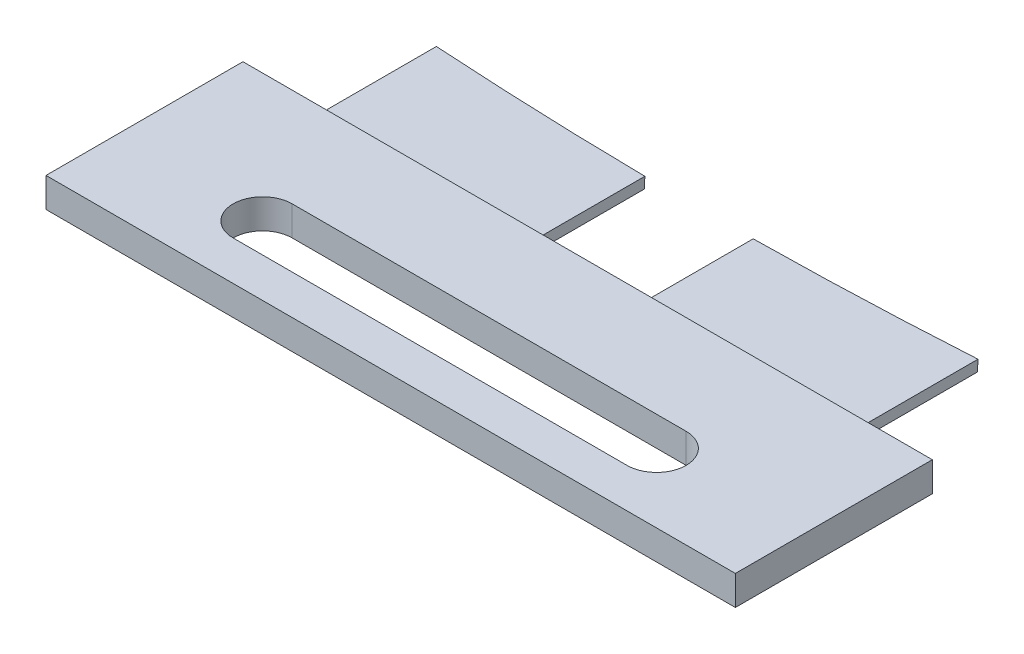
ISO-10303-21;
HEADER;
FILE_DESCRIPTION(('STEP AP214'),'2;1');
FILE_NAME('part.step','',(''),(''),'','','');
FILE_SCHEMA(('AUTOMOTIVE_DESIGN { 1 0 10303 214 1 1 1 1 }'));
ENDSEC;
DATA;
#1=APPLICATION_CONTEXT('core data for automotive mechanical design processes');
#2=APPLICATION_PROTOCOL_DEFINITION('international standard','automotive_design',2000,#1);
#3=PRODUCT_CONTEXT('',#1,'mechanical');
#4=PRODUCT('Part','Part','',(#3));
#5=PRODUCT_RELATED_PRODUCT_CATEGORY('part','',(#4));
#6=PRODUCT_DEFINITION_FORMATION('','',#4);
#7=PRODUCT_DEFINITION_CONTEXT('part definition',#1,'design');
#8=PRODUCT_DEFINITION('design','',#6,#7);
#9=PRODUCT_DEFINITION_SHAPE('','',#8);
#10=(LENGTH_UNIT() NAMED_UNIT(*) SI_UNIT(.MILLI.,.METRE.));
#11=(NAMED_UNIT(*) PLANE_ANGLE_UNIT() SI_UNIT($,.RADIAN.));
#12=(NAMED_UNIT(*) SI_UNIT($,.STERADIAN.) SOLID_ANGLE_UNIT());
#13=UNCERTAINTY_MEASURE_WITH_UNIT(LENGTH_MEASURE(1.E-05),#10,'distance_accuracy_value','');
#14=(GEOMETRIC_REPRESENTATION_CONTEXT(3) GLOBAL_UNCERTAINTY_ASSIGNED_CONTEXT((#13)) GLOBAL_UNIT_ASSIGNED_CONTEXT((#10,
#11,#12)) REPRESENTATION_CONTEXT('',''));
#15=CARTESIAN_POINT('',(0.,0.,0.));
#16=DIRECTION('',(0.,0.,1.));
#17=DIRECTION('',(1.,0.,0.));
#18=AXIS2_PLACEMENT_3D('',#15,#16,#17);
#19=CARTESIAN_POINT('',(-27.469753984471,-2.07937863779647E-12,23.2707232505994));
#20=DIRECTION('',(1.,0.,0.));
#21=DIRECTION('',(0.,1.,0.));
#22=AXIS2_PLACEMENT_3D('',#19,#20,#21);
#23=PLANE('',#22);
#24=CARTESIAN_POINT('',(-27.4697539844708,-2.45782713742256,25.6413464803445));
#25=CARTESIAN_POINT('',(-27.4697539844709,-1.14642170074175,25.5724833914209));
#26=CARTESIAN_POINT('',(-27.469753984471,0.164983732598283,25.5036202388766));
#27=CARTESIAN_POINT('',(-27.4697539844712,2.78779459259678,25.3658938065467));
#28=CARTESIAN_POINT('',(-27.4697539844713,4.09920001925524,25.2970305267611));
#29=CARTESIAN_POINT('',(-27.4697539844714,5.41060544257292,25.2281671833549));
#30=B_SPLINE_CURVE_WITH_KNOTS('',3,(#24,#25,#26,#27,#28,#29),.UNSPECIFIED.,.F.,.F.,(4,2,4),(0.,
3.93963667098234,7.87927334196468),.UNSPECIFIED.);
#31=CARTESIAN_POINT('',(-27.4697539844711,1.1961213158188,25.4494741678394));
#32=VERTEX_POINT('',#31);
#33=CARTESIAN_POINT('',(-27.4697539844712,2.2961213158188,25.3917120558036));
#34=VERTEX_POINT('',#33);
#35=EDGE_CURVE('E267',#32,#34,#30,.T.);
#36=ORIENTED_EDGE('',*,*,#35,.F.);
#37=DIRECTION('',(0.,0.,1.));
#38=VECTOR('',#37,1.);
#39=CARTESIAN_POINT('',(-27.4697539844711,1.1961213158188,23.2707232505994));
#40=LINE('',#39,#38);
#41=CARTESIAN_POINT('',(-27.4697539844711,1.1961213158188,37.5));
#42=VERTEX_POINT('',#41);
#43=EDGE_CURVE('E39',#32,#42,#40,.T.);
#44=ORIENTED_EDGE('',*,*,#43,.T.);
#45=DIRECTION('',(0.,1.,0.));
#46=VECTOR('',#45,1.);
#47=CARTESIAN_POINT('',(-27.469753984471,-2.07937863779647E-12,37.5));
#48=LINE('',#47,#46);
#49=CARTESIAN_POINT('',(-27.4697539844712,2.2961213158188,37.5));
#50=VERTEX_POINT('',#49);
#51=EDGE_CURVE('E283',#42,#50,#48,.T.);
#52=ORIENTED_EDGE('',*,*,#51,.T.);
#53=DIRECTION('',(0.,0.,1.));
#54=VECTOR('',#53,1.);
#55=CARTESIAN_POINT('',(-27.4697539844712,2.2961213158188,23.2707232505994));
#56=LINE('',#55,#54);
#57=EDGE_CURVE('E279',#34,#50,#56,.T.);
#58=ORIENTED_EDGE('',*,*,#57,.F.);
#59=EDGE_LOOP('',(#36,#44,#52,#58));
#60=FACE_BOUND('',#59,.T.);
#61=ADVANCED_FACE('F34',(#60),#23,.F.);
#62=CARTESIAN_POINT('',(0.,2.2961213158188,23.2707232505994));
#63=DIRECTION('',(0.,-1.,0.));
#64=DIRECTION('',(0.,0.,-1.));
#65=AXIS2_PLACEMENT_3D('',#62,#63,#64);
#66=PLANE('',#65);
#67=CARTESIAN_POINT('',(0.0302460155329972,2.2961213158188,-412.499994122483));
#68=DIRECTION('',(0.,-1.,0.));
#69=DIRECTION('',(0.,0.,-1.));
#70=AXIS2_PLACEMENT_3D('',#67,#68,#69);
#71=CIRCLE('',#70,438.754369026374);
#72=CARTESIAN_POINT('',(-5.46975398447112,2.2961213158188,26.2199009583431));
#73=VERTEX_POINT('',#72);
#74=EDGE_CURVE('E44',#34,#73,#71,.F.);
#75=ORIENTED_EDGE('',*,*,#74,.F.);
#76=ORIENTED_EDGE('',*,*,#57,.T.);
#77=DIRECTION('',(1.,0.,0.));
#78=VECTOR('',#77,1.);
#79=CARTESIAN_POINT('',(0.,2.2961213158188,37.5));
#80=LINE('',#79,#78);
#81=CARTESIAN_POINT('',(-5.46975398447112,2.2961213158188,37.5));
#82=VERTEX_POINT('',#81);
#83=EDGE_CURVE('E282',#50,#82,#80,.T.);
#84=ORIENTED_EDGE('',*,*,#83,.T.);
#85=DIRECTION('',(0.,0.,1.));
#86=VECTOR('',#85,1.);
#87=CARTESIAN_POINT('',(-5.46975398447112,2.2961213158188,23.2707232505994));
#88=LINE('',#87,#86);
#89=EDGE_CURVE('E284',#73,#82,#88,.T.);
#90=ORIENTED_EDGE('',*,*,#89,.F.);
#91=EDGE_LOOP('',(#75,#76,#84,#90));
#92=FACE_BOUND('',#91,.T.);
#93=ADVANCED_FACE('F255',(#92),#66,.F.);
#94=CARTESIAN_POINT('',(-5.46975398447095,-3.96792263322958E-13,23.2707232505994));
#95=DIRECTION('',(-1.,0.,0.));
#96=DIRECTION('',(0.,-1.,0.));
#97=AXIS2_PLACEMENT_3D('',#94,#95,#96);
#98=PLANE('',#97);
#99=CARTESIAN_POINT('',(-5.46975398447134,5.40928791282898,26.0567339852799));
#100=CARTESIAN_POINT('',(-5.46975398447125,4.09787568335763,26.1254675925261));
#101=CARTESIAN_POINT('',(-5.46975398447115,2.78646345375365,26.1942011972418));
#102=CARTESIAN_POINT('',(-5.46975398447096,0.163638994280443,26.3316684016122));
#103=CARTESIAN_POINT('',(-5.46975398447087,-1.14777323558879,26.4004020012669));
#104=CARTESIAN_POINT('',(-5.46975398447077,-2.45918546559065,26.4691355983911));
#105=B_SPLINE_CURVE_WITH_KNOTS('',3,(#99,#100,#101,#102,#103,#104),.UNSPECIFIED.,.F.,.F.,(4,2,
4),(0.,3.93963667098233,7.87927334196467),.UNSPECIFIED.);
#106=CARTESIAN_POINT('',(-5.46975398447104,1.1961213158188,26.2775540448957));
#107=VERTEX_POINT('',#106);
#108=EDGE_CURVE('E11',#73,#107,#105,.T.);
#109=ORIENTED_EDGE('',*,*,#108,.F.);
#110=ORIENTED_EDGE('',*,*,#89,.T.);
#111=DIRECTION('',(0.,-1.,0.));
#112=VECTOR('',#111,1.);
#113=CARTESIAN_POINT('',(-5.46975398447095,-3.96792263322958E-13,37.5));
#114=LINE('',#113,#112);
#115=CARTESIAN_POINT('',(-5.46975398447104,1.1961213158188,37.5));
#116=VERTEX_POINT('',#115);
#117=EDGE_CURVE('E286',#82,#116,#114,.T.);
#118=ORIENTED_EDGE('',*,*,#117,.T.);
#119=DIRECTION('',(0.,0.,1.));
#120=VECTOR('',#119,1.);
#121=CARTESIAN_POINT('',(-5.46975398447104,1.1961213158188,23.2707232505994));
#122=LINE('',#121,#120);
#123=EDGE_CURVE('E287',#107,#116,#122,.T.);
#124=ORIENTED_EDGE('',*,*,#123,.F.);
#125=EDGE_LOOP('',(#109,#110,#118,#124));
#126=FACE_BOUND('',#125,.T.);
#127=ADVANCED_FACE('F260',(#126),#98,.F.);
#128=CARTESIAN_POINT('',(0.,1.1961213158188,23.2707232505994));
#129=DIRECTION('',(0.,1.,0.));
#130=DIRECTION('',(-1.,0.,0.));
#131=AXIS2_PLACEMENT_3D('',#128,#129,#130);
#132=PLANE('',#131);
#133=CARTESIAN_POINT('',(0.0302460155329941,1.1961213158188,-412.499994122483));
#134=DIRECTION('',(0.,1.,0.));
#135=DIRECTION('',(-1.,0.,0.));
#136=AXIS2_PLACEMENT_3D('',#133,#134,#135);
#137=CIRCLE('',#136,438.812017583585);
#138=EDGE_CURVE('E275',#107,#32,#137,.F.);
#139=ORIENTED_EDGE('',*,*,#138,.F.);
#140=ORIENTED_EDGE('',*,*,#123,.T.);
#141=DIRECTION('',(-1.,0.,0.));
#142=VECTOR('',#141,1.);
#143=CARTESIAN_POINT('',(0.,1.1961213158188,37.5));
#144=LINE('',#143,#142);
#145=EDGE_CURVE('E278',#116,#42,#144,.T.);
#146=ORIENTED_EDGE('',*,*,#145,.T.);
#147=ORIENTED_EDGE('',*,*,#43,.F.);
#148=EDGE_LOOP('',(#139,#140,#146,#147));
#149=FACE_BOUND('',#148,.T.);
#150=ADVANCED_FACE('F307',(#149),#132,.F.);
#151=CARTESIAN_POINT('',(0.0302460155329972,-0.511448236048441,-412.499994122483));
#152=DIRECTION('',(0.,-1.,0.));
#153=DIRECTION('',(0.,0.,1.));
#154=AXIS2_PLACEMENT_3D('',#151,#152,#153);
#155=CONICAL_SURFACE('',#154,438.90150751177,0.05235987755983);
#156=ORIENTED_EDGE('',*,*,#138,.T.);
#157=ORIENTED_EDGE('',*,*,#35,.T.);
#158=ORIENTED_EDGE('',*,*,#74,.T.);
#159=ORIENTED_EDGE('',*,*,#108,.T.);
#160=EDGE_LOOP('',(#156,#157,#158,#159));
#161=FACE_BOUND('',#160,.T.);
#162=ADVANCED_FACE('F36',(#161),#155,.F.);
#163=CARTESIAN_POINT('',(-35.,3.2461213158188,57.5));
#164=DIRECTION('',(1.,0.,0.));
#165=DIRECTION('',(0.,0.,-1.));
#166=AXIS2_PLACEMENT_3D('',#163,#164,#165);
#167=PLANE('',#166);
#168=DIRECTION('',(0.,-1.,0.));
#169=VECTOR('',#168,1.);
#170=CARTESIAN_POINT('',(-35.,3.2461213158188,37.5));
#171=LINE('',#170,#169);
#172=CARTESIAN_POINT('',(-35.,3.2461213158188,37.5));
#173=VERTEX_POINT('',#172);
#174=CARTESIAN_POINT('',(-35.,0.246121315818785,37.5));
#175=VERTEX_POINT('',#174);
#176=EDGE_CURVE('E336',#173,#175,#171,.T.);
#177=ORIENTED_EDGE('',*,*,#176,.T.);
#178=DIRECTION('',(0.,0.,-1.));
#179=VECTOR('',#178,1.);
#180=CARTESIAN_POINT('',(-35.,0.246121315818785,57.5));
#181=LINE('',#180,#179);
#182=CARTESIAN_POINT('',(-35.,0.246121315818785,57.5));
#183=VERTEX_POINT('',#182);
#184=EDGE_CURVE('E362',#183,#175,#181,.T.);
#185=ORIENTED_EDGE('',*,*,#184,.F.);
#186=DIRECTION('',(0.,-1.,0.));
#187=VECTOR('',#186,1.);
#188=CARTESIAN_POINT('',(-35.,3.2461213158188,57.5));
#189=LINE('',#188,#187);
#190=CARTESIAN_POINT('',(-35.,3.2461213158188,57.5));
#191=VERTEX_POINT('',#190);
#192=EDGE_CURVE('E354',#191,#183,#189,.T.);
#193=ORIENTED_EDGE('',*,*,#192,.F.);
#194=DIRECTION('',(0.,0.,-1.));
#195=VECTOR('',#194,1.);
#196=CARTESIAN_POINT('',(-35.,3.2461213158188,57.5));
#197=LINE('',#196,#195);
#198=EDGE_CURVE('E355',#191,#173,#197,.T.);
#199=ORIENTED_EDGE('',*,*,#198,.T.);
#200=EDGE_LOOP('',(#177,#185,#193,#199));
#201=FACE_BOUND('',#200,.T.);
#202=ADVANCED_FACE('F310',(#201),#167,.F.);
#203=CARTESIAN_POINT('',(-35.,0.246121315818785,57.5));
#204=DIRECTION('',(0.,1.,0.));
#205=DIRECTION('',(-1.,0.,0.));
#206=AXIS2_PLACEMENT_3D('',#203,#204,#205);
#207=PLANE('',#206);
#208=DIRECTION('',(-1.,0.,0.));
#209=VECTOR('',#208,1.);
#210=CARTESIAN_POINT('',(-35.,0.246121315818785,47.5));
#211=LINE('',#210,#209);
#212=CARTESIAN_POINT('',(20.,0.246121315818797,47.5));
#213=VERTEX_POINT('',#212);
#214=CARTESIAN_POINT('',(-20.,0.246121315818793,47.5));
#215=VERTEX_POINT('',#214);
#216=EDGE_CURVE('E181',#213,#215,#211,.T.);
#217=ORIENTED_EDGE('',*,*,#216,.T.);
#218=CARTESIAN_POINT('',(-20.,0.24612131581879,50.5));
#219=DIRECTION('',(0.,1.,0.));
#220=DIRECTION('',(-1.,0.,0.));
#221=AXIS2_PLACEMENT_3D('',#218,#219,#220);
#222=CIRCLE('',#221,2.99999999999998);
#223=CARTESIAN_POINT('',(-20.,0.246121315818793,53.5));
#224=VERTEX_POINT('',#223);
#225=EDGE_CURVE('E184',#215,#224,#222,.T.);
#226=ORIENTED_EDGE('',*,*,#225,.T.);
#227=DIRECTION('',(1.,0.,0.));
#228=VECTOR('',#227,1.);
#229=CARTESIAN_POINT('',(-35.,0.246121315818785,53.5));
#230=LINE('',#229,#228);
#231=CARTESIAN_POINT('',(20.,0.246121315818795,53.5));
#232=VERTEX_POINT('',#231);
#233=EDGE_CURVE('E176',#224,#232,#230,.T.);
#234=ORIENTED_EDGE('',*,*,#233,.T.);
#235=CARTESIAN_POINT('',(20.,0.246121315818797,50.5));
#236=DIRECTION('',(0.,1.,0.));
#237=DIRECTION('',(-1.,0.,0.));
#238=AXIS2_PLACEMENT_3D('',#235,#236,#237);
#239=CIRCLE('',#238,2.99999999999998);
#240=EDGE_CURVE('E156',#232,#213,#239,.T.);
#241=ORIENTED_EDGE('',*,*,#240,.T.);
#242=EDGE_LOOP('',(#217,#226,#234,#241));
#243=FACE_BOUND('',#242,.T.);
#244=DIRECTION('',(1.,0.,0.));
#245=VECTOR('',#244,1.);
#246=CARTESIAN_POINT('',(-35.,0.246121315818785,37.5));
#247=LINE('',#246,#245);
#248=CARTESIAN_POINT('',(35.,0.246121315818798,37.5));
#249=VERTEX_POINT('',#248);
#250=EDGE_CURVE('E339',#175,#249,#247,.T.);
#251=ORIENTED_EDGE('',*,*,#250,.T.);
#252=DIRECTION('',(0.,0.,-1.));
#253=VECTOR('',#252,1.);
#254=CARTESIAN_POINT('',(35.,0.246121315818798,57.5));
#255=LINE('',#254,#253);
#256=CARTESIAN_POINT('',(35.,0.246121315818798,57.5));
#257=VERTEX_POINT('',#256);
#258=EDGE_CURVE('E360',#257,#249,#255,.T.);
#259=ORIENTED_EDGE('',*,*,#258,.F.);
#260=DIRECTION('',(1.,0.,0.));
#261=VECTOR('',#260,1.);
#262=CARTESIAN_POINT('',(-35.,0.246121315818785,57.5));
#263=LINE('',#262,#261);
#264=EDGE_CURVE('E471',#183,#257,#263,.T.);
#265=ORIENTED_EDGE('',*,*,#264,.F.);
#266=ORIENTED_EDGE('',*,*,#184,.T.);
#267=EDGE_LOOP('',(#251,#259,#265,#266));
#268=FACE_BOUND('',#267,.T.);
#269=ADVANCED_FACE('F313',(#243,#268),#207,.F.);
#270=CARTESIAN_POINT('',(35.,3.2461213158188,57.5));
#271=DIRECTION('',(-1.,0.,0.));
#272=DIRECTION('',(0.,0.,1.));
#273=AXIS2_PLACEMENT_3D('',#270,#271,#272);
#274=PLANE('',#273);
#275=DIRECTION('',(0.,1.,0.));
#276=VECTOR('',#275,1.);
#277=CARTESIAN_POINT('',(35.,3.2461213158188,37.5));
#278=LINE('',#277,#276);
#279=CARTESIAN_POINT('',(35.,3.2461213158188,37.5));
#280=VERTEX_POINT('',#279);
#281=EDGE_CURVE('E344',#249,#280,#278,.T.);
#282=ORIENTED_EDGE('',*,*,#281,.T.);
#283=DIRECTION('',(0.,0.,-1.));
#284=VECTOR('',#283,1.);
#285=CARTESIAN_POINT('',(35.,3.2461213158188,57.5));
#286=LINE('',#285,#284);
#287=CARTESIAN_POINT('',(35.,3.2461213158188,57.5));
#288=VERTEX_POINT('',#287);
#289=EDGE_CURVE('E357',#288,#280,#286,.T.);
#290=ORIENTED_EDGE('',*,*,#289,.F.);
#291=DIRECTION('',(0.,1.,0.));
#292=VECTOR('',#291,1.);
#293=CARTESIAN_POINT('',(35.,3.2461213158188,57.5));
#294=LINE('',#293,#292);
#295=EDGE_CURVE('E469',#257,#288,#294,.T.);
#296=ORIENTED_EDGE('',*,*,#295,.F.);
#297=ORIENTED_EDGE('',*,*,#258,.T.);
#298=EDGE_LOOP('',(#282,#290,#296,#297));
#299=FACE_BOUND('',#298,.T.);
#300=ADVANCED_FACE('F317',(#299),#274,.F.);
#301=CARTESIAN_POINT('',(-35.,3.2461213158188,57.5));
#302=DIRECTION('',(0.,-1.,0.));
#303=DIRECTION('',(0.,0.,-1.));
#304=AXIS2_PLACEMENT_3D('',#301,#302,#303);
#305=PLANE('',#304);
#306=DIRECTION('',(1.,0.,0.));
#307=VECTOR('',#306,1.);
#308=CARTESIAN_POINT('',(-20.,3.2461213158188,53.5));
#309=LINE('',#308,#307);
#310=CARTESIAN_POINT('',(-20.,3.2461213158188,53.5));
#311=VERTEX_POINT('',#310);
#312=CARTESIAN_POINT('',(20.,3.2461213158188,53.5));
#313=VERTEX_POINT('',#312);
#314=EDGE_CURVE('E162',#311,#313,#309,.T.);
#315=ORIENTED_EDGE('',*,*,#314,.F.);
#316=CARTESIAN_POINT('',(-20.,3.2461213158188,50.5));
#317=DIRECTION('',(0.,1.,0.));
#318=DIRECTION('',(0.,0.,1.));
#319=AXIS2_PLACEMENT_3D('',#316,#317,#318);
#320=CIRCLE('',#319,2.99999999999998);
#321=CARTESIAN_POINT('',(-20.,3.2461213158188,47.5));
#322=VERTEX_POINT('',#321);
#323=EDGE_CURVE('E60',#322,#311,#320,.T.);
#324=ORIENTED_EDGE('',*,*,#323,.F.);
#325=DIRECTION('',(-1.,0.,0.));
#326=VECTOR('',#325,1.);
#327=CARTESIAN_POINT('',(-20.,3.2461213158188,47.5));
#328=LINE('',#327,#326);
#329=CARTESIAN_POINT('',(20.,3.2461213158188,47.5));
#330=VERTEX_POINT('',#329);
#331=EDGE_CURVE('E169',#330,#322,#328,.T.);
#332=ORIENTED_EDGE('',*,*,#331,.F.);
#333=CARTESIAN_POINT('',(20.,3.2461213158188,50.5));
#334=DIRECTION('',(0.,1.,0.));
#335=DIRECTION('',(0.,0.,1.));
#336=AXIS2_PLACEMENT_3D('',#333,#334,#335);
#337=CIRCLE('',#336,2.99999999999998);
#338=EDGE_CURVE('E153',#313,#330,#337,.T.);
#339=ORIENTED_EDGE('',*,*,#338,.F.);
#340=EDGE_LOOP('',(#315,#324,#332,#339));
#341=FACE_BOUND('',#340,.T.);
#342=DIRECTION('',(-1.,0.,0.));
#343=VECTOR('',#342,1.);
#344=CARTESIAN_POINT('',(-35.,3.2461213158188,37.5));
#345=LINE('',#344,#343);
#346=EDGE_CURVE('E338',#280,#173,#345,.T.);
#347=ORIENTED_EDGE('',*,*,#346,.T.);
#348=ORIENTED_EDGE('',*,*,#198,.F.);
#349=DIRECTION('',(-1.,0.,0.));
#350=VECTOR('',#349,1.);
#351=CARTESIAN_POINT('',(-35.,3.2461213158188,57.5));
#352=LINE('',#351,#350);
#353=EDGE_CURVE('E349',#288,#191,#352,.T.);
#354=ORIENTED_EDGE('',*,*,#353,.F.);
#355=ORIENTED_EDGE('',*,*,#289,.T.);
#356=EDGE_LOOP('',(#347,#348,#354,#355));
#357=FACE_BOUND('',#356,.T.);
#358=ADVANCED_FACE('F166',(#341,#357),#305,.F.);
#359=CARTESIAN_POINT('',(0.,0.,57.5));
#360=DIRECTION('',(0.,0.,1.));
#361=DIRECTION('',(1.,0.,0.));
#362=AXIS2_PLACEMENT_3D('',#359,#360,#361);
#363=PLANE('',#362);
#364=ORIENTED_EDGE('',*,*,#192,.T.);
#365=ORIENTED_EDGE('',*,*,#264,.T.);
#366=ORIENTED_EDGE('',*,*,#295,.T.);
#367=ORIENTED_EDGE('',*,*,#353,.T.);
#368=EDGE_LOOP('',(#364,#365,#366,#367));
#369=FACE_BOUND('',#368,.T.);
#370=ADVANCED_FACE('F229',(#369),#363,.T.);
#371=CARTESIAN_POINT('',(0.,0.,37.5));
#372=DIRECTION('',(0.,0.,1.));
#373=DIRECTION('',(1.,0.,0.));
#374=AXIS2_PLACEMENT_3D('',#371,#372,#373);
#375=PLANE('',#374);
#376=DIRECTION('',(0.,-1.,0.));
#377=VECTOR('',#376,1.);
#378=CARTESIAN_POINT('',(5.53024601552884,2.2961213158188,37.5));
#379=LINE('',#378,#377);
#380=CARTESIAN_POINT('',(5.53024601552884,2.2961213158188,37.5));
#381=VERTEX_POINT('',#380);
#382=CARTESIAN_POINT('',(5.53024601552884,1.1961213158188,37.5));
#383=VERTEX_POINT('',#382);
#384=EDGE_CURVE('E187',#381,#383,#379,.T.);
#385=ORIENTED_EDGE('',*,*,#384,.T.);
#386=DIRECTION('',(1.,0.,0.));
#387=VECTOR('',#386,1.);
#388=CARTESIAN_POINT('',(5.53024601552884,1.1961213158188,37.5));
#389=LINE('',#388,#387);
#390=CARTESIAN_POINT('',(27.5302460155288,1.1961213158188,37.5));
#391=VERTEX_POINT('',#390);
#392=EDGE_CURVE('E195',#383,#391,#389,.T.);
#393=ORIENTED_EDGE('',*,*,#392,.T.);
#394=DIRECTION('',(0.,1.,0.));
#395=VECTOR('',#394,1.);
#396=CARTESIAN_POINT('',(27.5302460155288,1.1961213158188,37.5));
#397=LINE('',#396,#395);
#398=CARTESIAN_POINT('',(27.5302460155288,2.2961213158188,37.5));
#399=VERTEX_POINT('',#398);
#400=EDGE_CURVE('E192',#391,#399,#397,.T.);
#401=ORIENTED_EDGE('',*,*,#400,.T.);
#402=DIRECTION('',(-1.,0.,0.));
#403=VECTOR('',#402,1.);
#404=CARTESIAN_POINT('',(27.5302460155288,2.2961213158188,37.5));
#405=LINE('',#404,#403);
#406=EDGE_CURVE('E188',#399,#381,#405,.T.);
#407=ORIENTED_EDGE('',*,*,#406,.T.);
#408=EDGE_LOOP('',(#385,#393,#401,#407));
#409=FACE_BOUND('',#408,.T.);
#410=ORIENTED_EDGE('',*,*,#51,.F.);
#411=ORIENTED_EDGE('',*,*,#145,.F.);
#412=ORIENTED_EDGE('',*,*,#117,.F.);
#413=ORIENTED_EDGE('',*,*,#83,.F.);
#414=EDGE_LOOP('',(#410,#411,#412,#413));
#415=FACE_BOUND('',#414,.T.);
#416=ORIENTED_EDGE('',*,*,#176,.F.);
#417=ORIENTED_EDGE('',*,*,#346,.F.);
#418=ORIENTED_EDGE('',*,*,#281,.F.);
#419=ORIENTED_EDGE('',*,*,#250,.F.);
#420=EDGE_LOOP('',(#416,#417,#418,#419));
#421=FACE_BOUND('',#420,.T.);
#422=ADVANCED_FACE('F226',(#409,#415,#421),#375,.F.);
#423=CARTESIAN_POINT('',(0.0302460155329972,-0.511448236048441,-412.499994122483));
#424=DIRECTION('',(0.,-1.,0.));
#425=DIRECTION('',(0.,0.,1.));
#426=AXIS2_PLACEMENT_3D('',#423,#424,#425);
#427=CONICAL_SURFACE('',#426,438.90150751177,0.05235987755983);
#428=CARTESIAN_POINT('',(5.53024601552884,5.40928791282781,26.0567339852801));
#429=CARTESIAN_POINT('',(5.53024601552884,4.09787568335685,26.1254675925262));
#430=CARTESIAN_POINT('',(5.53024601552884,2.78646345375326,26.1942011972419));
#431=CARTESIAN_POINT('',(5.53024601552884,0.163638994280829,26.3316684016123));
#432=CARTESIAN_POINT('',(5.53024601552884,-1.14777323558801,26.400402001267));
#433=CARTESIAN_POINT('',(5.53024601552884,-2.45918546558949,26.4691355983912));
#434=B_SPLINE_CURVE_WITH_KNOTS('',3,(#428,#429,#430,#431,#432,#433),.UNSPECIFIED.,.F.,.F.,(4,2,
4),(0.,3.93963667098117,7.87927334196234),.UNSPECIFIED.);
#435=CARTESIAN_POINT('',(5.53024601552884,2.2961213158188,26.2199009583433));
#436=VERTEX_POINT('',#435);
#437=CARTESIAN_POINT('',(5.53024601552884,1.1961213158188,26.2775540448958));
#438=VERTEX_POINT('',#437);
#439=EDGE_CURVE('E203',#436,#438,#434,.T.);
#440=ORIENTED_EDGE('',*,*,#439,.F.);
#441=CARTESIAN_POINT('',(0.0302460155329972,2.2961213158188,-412.499994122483));
#442=DIRECTION('',(0.,1.,0.));
#443=DIRECTION('',(0.,0.,1.));
#444=AXIS2_PLACEMENT_3D('',#441,#442,#443);
#445=CIRCLE('',#444,438.754369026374);
#446=CARTESIAN_POINT('',(27.5302460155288,2.2961213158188,25.3917120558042));
#447=VERTEX_POINT('',#446);
#448=EDGE_CURVE('E214',#447,#436,#445,.F.);
#449=ORIENTED_EDGE('',*,*,#448,.F.);
#450=CARTESIAN_POINT('',(27.5302460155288,-2.45782713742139,25.641346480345));
#451=CARTESIAN_POINT('',(27.5302460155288,-1.14642170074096,25.5724833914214));
#452=CARTESIAN_POINT('',(27.5302460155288,0.164983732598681,25.5036202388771));
#453=CARTESIAN_POINT('',(27.5302460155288,2.7877945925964,25.3658938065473));
#454=CARTESIAN_POINT('',(27.5302460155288,4.09920001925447,25.2970305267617));
#455=CARTESIAN_POINT('',(27.5302460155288,5.41060544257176,25.2281671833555));
#456=B_SPLINE_CURVE_WITH_KNOTS('',3,(#450,#451,#452,#453,#454,#455),.UNSPECIFIED.,.F.,.F.,(4,2,
4),(0.,3.93963667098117,7.87927334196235),.UNSPECIFIED.);
#457=CARTESIAN_POINT('',(27.5302460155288,1.1961213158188,25.44947416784));
#458=VERTEX_POINT('',#457);
#459=EDGE_CURVE('E232',#458,#447,#456,.T.);
#460=ORIENTED_EDGE('',*,*,#459,.F.);
#461=CARTESIAN_POINT('',(0.0302460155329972,1.1961213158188,-412.499994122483));
#462=DIRECTION('',(0.,-1.,0.));
#463=DIRECTION('',(0.,0.,-1.));
#464=AXIS2_PLACEMENT_3D('',#461,#462,#463);
#465=CIRCLE('',#464,438.812017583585);
#466=EDGE_CURVE('E191',#438,#458,#465,.F.);
#467=ORIENTED_EDGE('',*,*,#466,.F.);
#468=EDGE_LOOP('',(#440,#449,#460,#467));
#469=FACE_BOUND('',#468,.T.);
#470=ADVANCED_FACE('F220',(#469),#427,.F.);
#471=CARTESIAN_POINT('',(5.53024601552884,1.1961213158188,23.2707232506));
#472=DIRECTION('',(0.,-1.,0.));
#473=DIRECTION('',(0.,0.,-1.));
#474=AXIS2_PLACEMENT_3D('',#471,#472,#473);
#475=PLANE('',#474);
#476=DIRECTION('',(0.,0.,1.));
#477=VECTOR('',#476,1.);
#478=CARTESIAN_POINT('',(5.53024601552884,1.1961213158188,23.2707232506));
#479=LINE('',#478,#477);
#480=EDGE_CURVE('E212',#438,#383,#479,.T.);
#481=ORIENTED_EDGE('',*,*,#480,.F.);
#482=ORIENTED_EDGE('',*,*,#466,.T.);
#483=DIRECTION('',(0.,0.,1.));
#484=VECTOR('',#483,1.);
#485=CARTESIAN_POINT('',(27.5302460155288,1.1961213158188,23.2707232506));
#486=LINE('',#485,#484);
#487=EDGE_CURVE('E202',#458,#391,#486,.T.);
#488=ORIENTED_EDGE('',*,*,#487,.T.);
#489=ORIENTED_EDGE('',*,*,#392,.F.);
#490=EDGE_LOOP('',(#481,#482,#488,#489));
#491=FACE_BOUND('',#490,.T.);
#492=ADVANCED_FACE('F225',(#491),#475,.T.);
#493=CARTESIAN_POINT('',(27.5302460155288,1.1961213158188,23.2707232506));
#494=DIRECTION('',(1.,0.,0.));
#495=DIRECTION('',(0.,0.,-1.));
#496=AXIS2_PLACEMENT_3D('',#493,#494,#495);
#497=PLANE('',#496);
#498=ORIENTED_EDGE('',*,*,#487,.F.);
#499=ORIENTED_EDGE('',*,*,#459,.T.);
#500=DIRECTION('',(0.,0.,1.));
#501=VECTOR('',#500,1.);
#502=CARTESIAN_POINT('',(27.5302460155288,2.2961213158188,23.2707232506));
#503=LINE('',#502,#501);
#504=EDGE_CURVE('E239',#447,#399,#503,.T.);
#505=ORIENTED_EDGE('',*,*,#504,.T.);
#506=ORIENTED_EDGE('',*,*,#400,.F.);
#507=EDGE_LOOP('',(#498,#499,#505,#506));
#508=FACE_BOUND('',#507,.T.);
#509=ADVANCED_FACE('F241',(#508),#497,.T.);
#510=CARTESIAN_POINT('',(27.5302460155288,2.2961213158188,23.2707232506));
#511=DIRECTION('',(0.,1.,0.));
#512=DIRECTION('',(0.,0.,1.));
#513=AXIS2_PLACEMENT_3D('',#510,#511,#512);
#514=PLANE('',#513);
#515=ORIENTED_EDGE('',*,*,#504,.F.);
#516=ORIENTED_EDGE('',*,*,#448,.T.);
#517=DIRECTION('',(0.,0.,1.));
#518=VECTOR('',#517,1.);
#519=CARTESIAN_POINT('',(5.53024601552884,2.2961213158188,23.2707232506));
#520=LINE('',#519,#518);
#521=EDGE_CURVE('E213',#436,#381,#520,.T.);
#522=ORIENTED_EDGE('',*,*,#521,.T.);
#523=ORIENTED_EDGE('',*,*,#406,.F.);
#524=EDGE_LOOP('',(#515,#516,#522,#523));
#525=FACE_BOUND('',#524,.T.);
#526=ADVANCED_FACE('F244',(#525),#514,.T.);
#527=CARTESIAN_POINT('',(5.53024601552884,2.2961213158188,23.2707232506));
#528=DIRECTION('',(-1.,0.,0.));
#529=DIRECTION('',(0.,0.,1.));
#530=AXIS2_PLACEMENT_3D('',#527,#528,#529);
#531=PLANE('',#530);
#532=ORIENTED_EDGE('',*,*,#521,.F.);
#533=ORIENTED_EDGE('',*,*,#439,.T.);
#534=ORIENTED_EDGE('',*,*,#480,.T.);
#535=ORIENTED_EDGE('',*,*,#384,.F.);
#536=EDGE_LOOP('',(#532,#533,#534,#535));
#537=FACE_BOUND('',#536,.T.);
#538=ADVANCED_FACE('F216',(#537),#531,.T.);
#539=CARTESIAN_POINT('',(-20.,-16.7538786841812,50.5));
#540=DIRECTION('',(0.,1.,0.));
#541=DIRECTION('',(0.,0.,1.));
#542=AXIS2_PLACEMENT_3D('',#539,#540,#541);
#543=CYLINDRICAL_SURFACE('',#542,2.99999999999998);
#544=DIRECTION('',(0.,1.,0.));
#545=VECTOR('',#544,1.);
#546=CARTESIAN_POINT('',(-20.,-16.7538786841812,47.5));
#547=LINE('',#546,#545);
#548=EDGE_CURVE('E174',#215,#322,#547,.T.);
#549=ORIENTED_EDGE('',*,*,#548,.T.);
#550=ORIENTED_EDGE('',*,*,#323,.T.);
#551=DIRECTION('',(0.,1.,0.));
#552=VECTOR('',#551,1.);
#553=CARTESIAN_POINT('',(-20.,-16.7538786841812,53.5));
#554=LINE('',#553,#552);
#555=EDGE_CURVE('E159',#224,#311,#554,.T.);
#556=ORIENTED_EDGE('',*,*,#555,.F.);
#557=ORIENTED_EDGE('',*,*,#225,.F.);
#558=EDGE_LOOP('',(#549,#550,#556,#557));
#559=FACE_BOUND('',#558,.T.);
#560=ADVANCED_FACE('F251',(#559),#543,.F.);
#561=CARTESIAN_POINT('',(-20.,-16.7538786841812,47.5));
#562=DIRECTION('',(0.,0.,-1.));
#563=DIRECTION('',(-1.,0.,0.));
#564=AXIS2_PLACEMENT_3D('',#561,#562,#563);
#565=PLANE('',#564);
#566=DIRECTION('',(0.,1.,0.));
#567=VECTOR('',#566,1.);
#568=CARTESIAN_POINT('',(20.,-16.7538786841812,47.5));
#569=LINE('',#568,#567);
#570=EDGE_CURVE('E158',#213,#330,#569,.T.);
#571=ORIENTED_EDGE('',*,*,#570,.T.);
#572=ORIENTED_EDGE('',*,*,#331,.T.);
#573=ORIENTED_EDGE('',*,*,#548,.F.);
#574=ORIENTED_EDGE('',*,*,#216,.F.);
#575=EDGE_LOOP('',(#571,#572,#573,#574));
#576=FACE_BOUND('',#575,.T.);
#577=ADVANCED_FACE('F437',(#576),#565,.F.);
#578=CARTESIAN_POINT('',(20.,-16.7538786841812,50.5));
#579=DIRECTION('',(0.,1.,0.));
#580=DIRECTION('',(0.,0.,1.));
#581=AXIS2_PLACEMENT_3D('',#578,#579,#580);
#582=CYLINDRICAL_SURFACE('',#581,2.99999999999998);
#583=DIRECTION('',(0.,1.,0.));
#584=VECTOR('',#583,1.);
#585=CARTESIAN_POINT('',(20.,-16.7538786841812,53.5));
#586=LINE('',#585,#584);
#587=EDGE_CURVE('E52',#232,#313,#586,.T.);
#588=ORIENTED_EDGE('',*,*,#587,.T.);
#589=ORIENTED_EDGE('',*,*,#338,.T.);
#590=ORIENTED_EDGE('',*,*,#570,.F.);
#591=ORIENTED_EDGE('',*,*,#240,.F.);
#592=EDGE_LOOP('',(#588,#589,#590,#591));
#593=FACE_BOUND('',#592,.T.);
#594=ADVANCED_FACE('F150',(#593),#582,.F.);
#595=CARTESIAN_POINT('',(-20.,-16.7538786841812,53.5));
#596=DIRECTION('',(0.,0.,1.));
#597=DIRECTION('',(1.,0.,0.));
#598=AXIS2_PLACEMENT_3D('',#595,#596,#597);
#599=PLANE('',#598);
#600=ORIENTED_EDGE('',*,*,#555,.T.);
#601=ORIENTED_EDGE('',*,*,#314,.T.);
#602=ORIENTED_EDGE('',*,*,#587,.F.);
#603=ORIENTED_EDGE('',*,*,#233,.F.);
#604=EDGE_LOOP('',(#600,#601,#602,#603));
#605=FACE_BOUND('',#604,.T.);
#606=ADVANCED_FACE('F163',(#605),#599,.F.);
#607=CLOSED_SHELL('',(#61,#93,#127,#150,#162,#202,#269,#300,#358,#370,#422,#470,#492,#509,#526,
#538,#560,#577,#594,#606));
#608=MANIFOLD_SOLID_BREP('B2',#607);
#609=ADVANCED_BREP_SHAPE_REPRESENTATION('',(#18,#608),#14);
#610=SHAPE_DEFINITION_REPRESENTATION(#9,#609);
ENDSEC;
END-ISO-10303-21;
